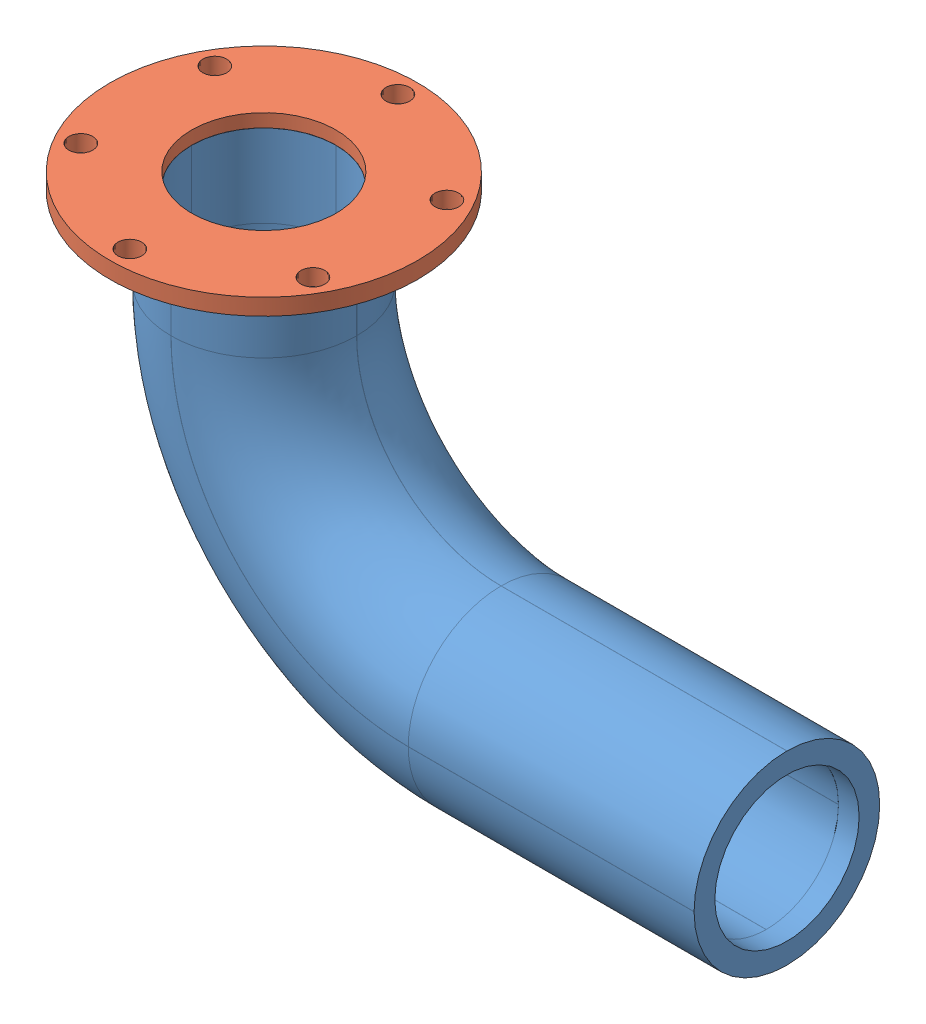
SolidWorks assembly Flanged Elbow.SLDASM, configuration Default (file format 12000). Lengths in mm.
Overall size (104.2 65.53 47.37).
2 component instances, 2 part files, 2 mates.
Components (placement in the parent):
- Elbow 1.0-1: Elbow 1.0.SLDPRT [Default] at (-4.4299 12.2887 77.7515) size (94.79 63.5 28.57)
- Flange-1: Flange.SLDPRT [Default] at (9.8449 77.8207 63.4513) x (1 0 0) z (0 -1 0) size (47.37 47.37 2.54)
Mates (geometry in assembly coordinates):
- Coincident2: coincident anti-aligned: plane of Elbow 1.0-1 through (-4.4299 75.7887 49.1765) normal (0 1 0); plane of Flange-1 through (9.8449 75.7887 63.4513) normal (0 -1 0)
- Concentric2: concentric aligned: cylinder of Elbow 1.0-1 through (9.8449 12.2887 63.4513) axis (0 -1 0) radius 11.0998; cylinder of Flange-1 through (9.8449 75.7887 63.4513) axis (0 -1 0) radius 14.2875
